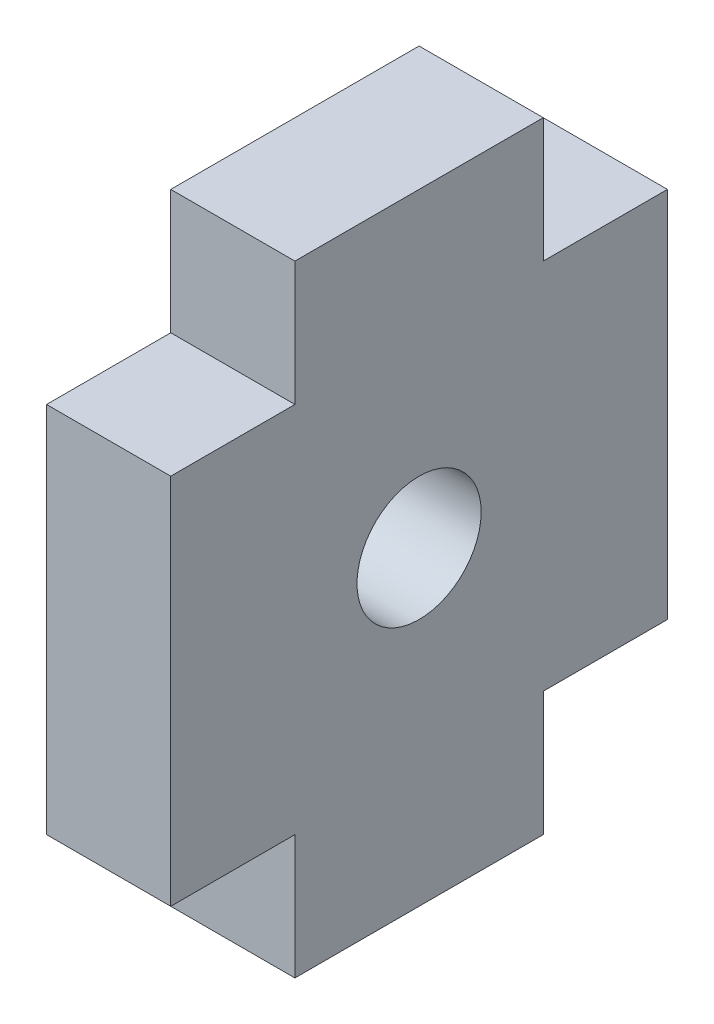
from build123d import *

# Parameters (mm, degrees)
SKETCH1_R           = 3.175
BOSS_EXTRUDE1_DEPTH = 3.175


with BuildPart() as part:
    # Sketch1 → Boss-Extrude1 (new, symmetric)
    with BuildSketch(Plane(origin=(0, 0, 0), x_dir=(0, 0, -1), z_dir=(1, 0, 0))):
        Polygon((6.35, 9.525), (12.7, 9.525), (12.7, -9.525), (6.35, -9.525), (6.35, -15.875), (-6.35, -15.875), (-6.35, -9.525), (-12.7, -9.525), (-12.7, 9.525), (-6.35, 9.525), (-6.35, 15.875), (6.35, 15.875), align=None)
        Circle(SKETCH1_R, mode=Mode.SUBTRACT)
    extrude(amount=BOSS_EXTRUDE1_DEPTH, both=True)


solid = part.part
